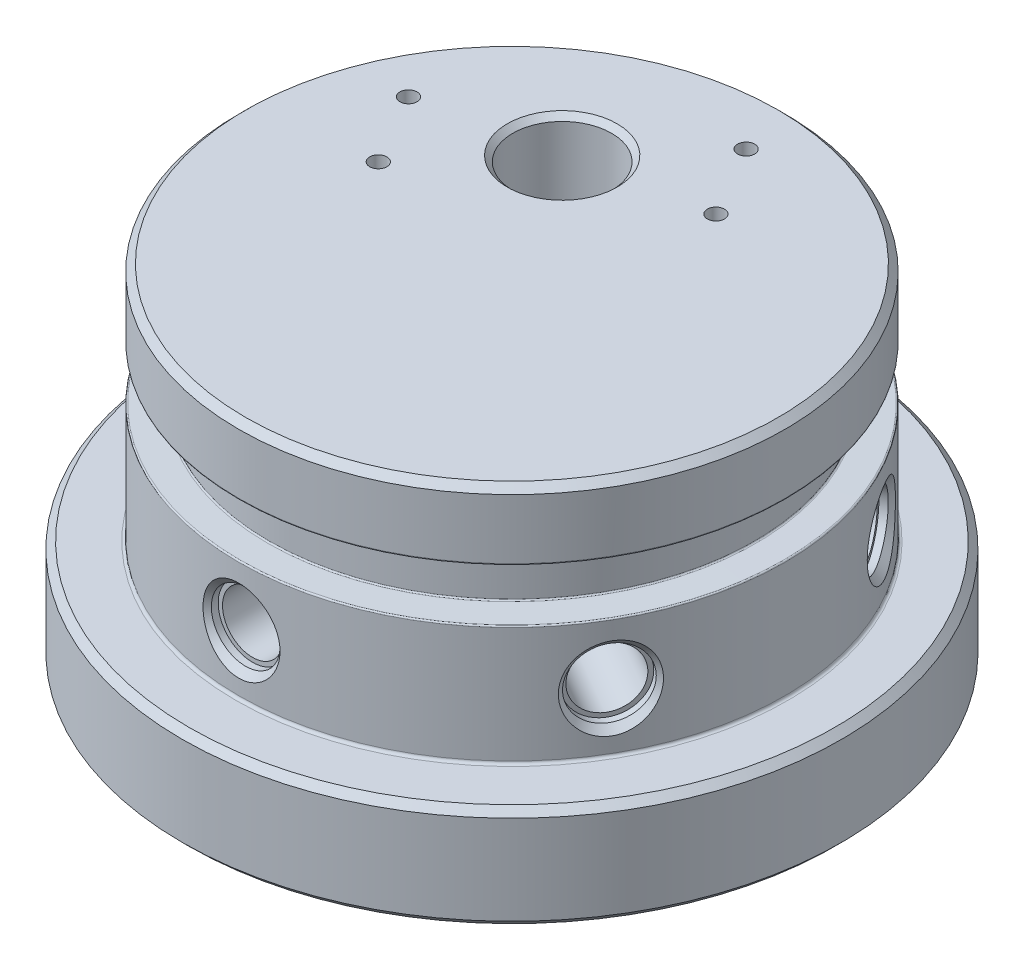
from build123d import *

# Parameters (mm, degrees)
SKETCH3_R                          = 30.48
BOSS_EXTRUDE2_DEPTH                = 15.875
SKETCH4_W                          = 5.2197
SKETCH4_H                          = 22.225
FILLET1_R                          = 0.127
CIRPATTERN2_COUNT                  = 6
F_1_16_0_0625_DIAMETER_HOLE1_D     = 1.5875
F_1_16_0_0625_DIAMETER_HOLE1_DEPTH = 6.35
F_1_16_0_0625_DIAMETER_HOLE1_TIP   = 0.476933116
CHAMFER1_SIZE                      = 0.635
FILLET2_R                          = 0.254


with BuildPart() as part:
    # Sketch3 → Boss-Extrude2 (new, symmetric)
    with BuildSketch(Plane(origin=(0, 0, 0), x_dir=(1, 0, 0), z_dir=(0, 1, 0))):
        with Locations(Location((0, 0, 0), (0, 0, 270))):
            Circle(SKETCH3_R)
    extrude(amount=BOSS_EXTRUDE2_DEPTH, both=True)

    # Sketch4 → Cut-Revolve1 (revolve, cut)
    with BuildSketch(Plane.XY, mode=Mode.PRIVATE) as cut_revolve1_sk:
        with Locations((27.87015, 4.7625)):
            Rectangle(SKETCH4_W, SKETCH4_H)
    revolve(cut_revolve1_sk.sketch.rotate(Axis((0, 17.4625, 0), (0, -1, 0)), 90), axis=Axis((0, 17.4625, 0), (0, -1, 0)), mode=Mode.SUBTRACT)

    # Sketch5 → Cut-Revolve2 (revolve, cut)
    with BuildSketch(Plane.XY, mode=Mode.PRIVATE) as cut_revolve2_sk:
        Polygon((22.4536, 9.525), (22.4536, 4.7752), (25.2603, 4.713957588), (25.2603, 9.586242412), align=None)
    revolve(cut_revolve2_sk.sketch.rotate(Axis((0, 17.4625, 0), (0, -1, 0)), 90), axis=Axis((0, 17.4625, 0), (0, -1, 0)), mode=Mode.SUBTRACT)

    # Fillet1
    fillet1_edges = [part.edges().sort_by_distance(p)[0] for p in [
        (0, 4.7752, -22.4536),
        (0, 4.713957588, -25.2603),
        (0, 9.586242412, -25.2603),
        (0, 9.525, -22.4536),
    ]]
    fillet(fillet1_edges, radius=FILLET1_R)

    # Sketch14 → CBORE for _8 Socket Head Cap Screw1 (revolve, cut)
    with BuildSketch(Plane(origin=(0, -0.880150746, 25.2603), x_dir=(0, -1, 0), z_dir=(1, 0, 0))):
        Polygon((0, 0), (0, 11.194265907), (2.778125, 9.525), (2.778125, 1.27), (3.175, 1.27), (3.175, 0.635), (3.81, 0), align=None)
    cbore_for_8_socket_head_cap_screw1 = revolve(axis=Axis((0, -0.880150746, 25.2603), (0, 0, -1)), mode=Mode.SUBTRACT)

    # CirPattern2: CBORE for _8 Socket Head Cap Screw1 ×6 about axis
    cirpattern2_axis = Axis((0, 0, 0), (0, 1, 0))
    for i in range(1, CIRPATTERN2_COUNT):
        add(cbore_for_8_socket_head_cap_screw1.rotate(cirpattern2_axis, i * 360 / CIRPATTERN2_COUNT), mode=Mode.SUBTRACT)

    # Sketch9 → 3_8 Clearance Hole1 (revolve, cut)
    with BuildSketch(Plane(origin=(-6.35, -15.875, -10.998522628), x_dir=(0, 0, -1), z_dir=(1, 0, 0))):
        Polygon((0, 0), (0, 31.75), (5.08, 31.75), (4.572, 31.242), (4.572, 0.508), (5.08, 0), align=None)
    revolve(axis=Axis((-6.35, -22.225, -10.998522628), (0, 1, 0)), mode=Mode.SUBTRACT)

    # 1_16 _0.0625_ Diameter Hole1
    with Locations(Plane(origin=(0, 15.875, 0), x_dir=(1, 0, 0), z_dir=(0, 1, 0))):
        with Locations((-14.343670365, 1.98396584), (-18.153670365, 8.583079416), (1.643670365, 20.013079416), (5.453670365, 13.41396584)):
            Hole(F_1_16_0_0625_DIAMETER_HOLE1_D / 2, depth=F_1_16_0_0625_DIAMETER_HOLE1_DEPTH)
            with Locations((0, 0, -(F_1_16_0_0625_DIAMETER_HOLE1_DEPTH + F_1_16_0_0625_DIAMETER_HOLE1_TIP / 2))):  # 118° drill point
                Cone(0, F_1_16_0_0625_DIAMETER_HOLE1_D / 2, F_1_16_0_0625_DIAMETER_HOLE1_TIP, mode=Mode.SUBTRACT)

    # Chamfer1
    chamfer1_edges = [part.edges().sort_by_distance(p)[0] for p in [
        (0, -15.875, -30.48),
        (0, -6.35, -30.48),
        (0, 15.875, -25.2603),
    ]]
    chamfer(chamfer1_edges, length=CHAMFER1_SIZE)

    # Fillet2
    fillet2_edges = [part.edges().sort_by_distance(p)[0] for p in [
        (0, -6.35, -25.2603),
    ]]
    fillet(fillet2_edges, radius=FILLET2_R)


solid = part.part
